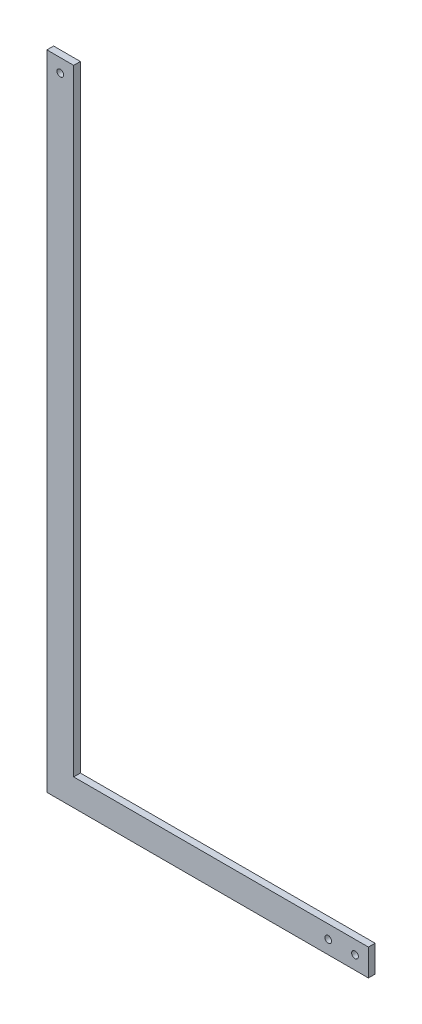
from build123d import *

# Parameters (mm, degrees)
SKETCH_1_R      = 1.5875
EXTRUDE_1_DEPTH = 3.175


with BuildPart() as part:
    # Sketch 1 → Extrude 1 (new body)
    with BuildSketch(Plane.XY):
        Polygon((-24.150819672, 246.504918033), (-24.150819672, -58.295081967), (128.249180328, -58.295081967), (128.249180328, -45.595081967), (-11.450819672, -45.595081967), (-11.450819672, 246.504918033), align=None)
        with Locations((-17.800819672, 240.154918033)):
            Circle(SKETCH_1_R, mode=Mode.SUBTRACT)
        with Locations((109.199180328, -51.945081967)):
            Circle(SKETCH_1_R, mode=Mode.SUBTRACT)
        with Locations((121.899180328, -51.945081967)):
            Circle(SKETCH_1_R, mode=Mode.SUBTRACT)
    extrude(amount=EXTRUDE_1_DEPTH)


solid = part.part
